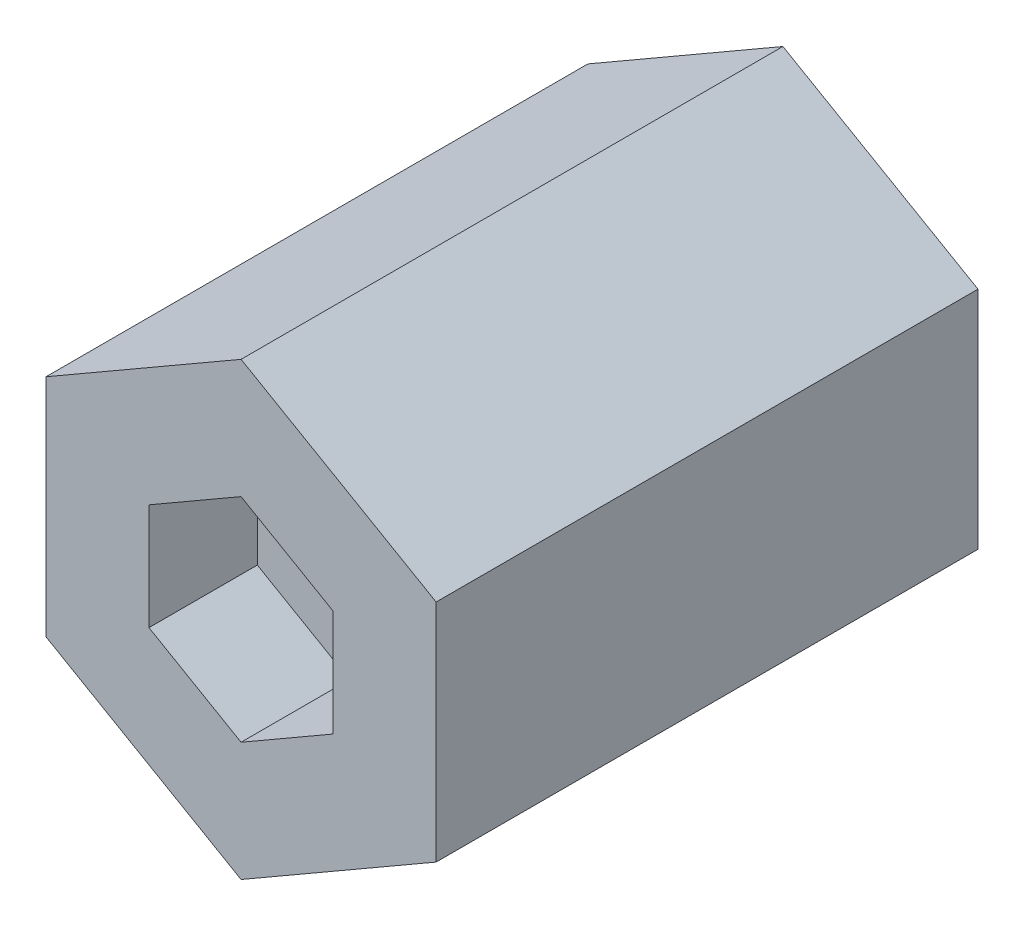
ISO-10303-21;
HEADER;
FILE_DESCRIPTION(('STEP AP214'),'2;1');
FILE_NAME('part.step','',(''),(''),'','','');
FILE_SCHEMA(('AUTOMOTIVE_DESIGN { 1 0 10303 214 1 1 1 1 }'));
ENDSEC;
DATA;
#1=APPLICATION_CONTEXT('core data for automotive mechanical design processes');
#2=APPLICATION_PROTOCOL_DEFINITION('international standard','automotive_design',2000,#1);
#3=PRODUCT_CONTEXT('',#1,'mechanical');
#4=PRODUCT('Part','Part','',(#3));
#5=PRODUCT_RELATED_PRODUCT_CATEGORY('part','',(#4));
#6=PRODUCT_DEFINITION_FORMATION('','',#4);
#7=PRODUCT_DEFINITION_CONTEXT('part definition',#1,'design');
#8=PRODUCT_DEFINITION('design','',#6,#7);
#9=PRODUCT_DEFINITION_SHAPE('','',#8);
#10=(LENGTH_UNIT() NAMED_UNIT(*) SI_UNIT(.MILLI.,.METRE.));
#11=(NAMED_UNIT(*) PLANE_ANGLE_UNIT() SI_UNIT($,.RADIAN.));
#12=(NAMED_UNIT(*) SI_UNIT($,.STERADIAN.) SOLID_ANGLE_UNIT());
#13=UNCERTAINTY_MEASURE_WITH_UNIT(LENGTH_MEASURE(1.E-05),#10,'distance_accuracy_value','');
#14=(GEOMETRIC_REPRESENTATION_CONTEXT(3) GLOBAL_UNCERTAINTY_ASSIGNED_CONTEXT((#13)) GLOBAL_UNIT_ASSIGNED_CONTEXT((#10,
#11,#12)) REPRESENTATION_CONTEXT('',''));
#15=CARTESIAN_POINT('',(0.,0.,0.));
#16=DIRECTION('',(0.,0.,1.));
#17=DIRECTION('',(1.,0.,0.));
#18=AXIS2_PLACEMENT_3D('',#15,#16,#17);
#19=CARTESIAN_POINT('',(18.,10.3923048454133,50.));
#20=DIRECTION('',(-0.5,-0.866025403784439,0.));
#21=DIRECTION('',(0.866025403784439,-0.5,0.));
#22=AXIS2_PLACEMENT_3D('',#19,#20,#21);
#23=PLANE('',#22);
#24=DIRECTION('',(-0.866025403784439,0.5,0.));
#25=VECTOR('',#24,1.);
#26=CARTESIAN_POINT('',(18.,10.3923048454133,0.));
#27=LINE('',#26,#25);
#28=CARTESIAN_POINT('',(18.,10.3923048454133,0.));
#29=VERTEX_POINT('',#28);
#30=CARTESIAN_POINT('',(0.,20.7846096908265,0.));
#31=VERTEX_POINT('',#30);
#32=EDGE_CURVE('E128',#29,#31,#27,.T.);
#33=ORIENTED_EDGE('',*,*,#32,.T.);
#34=DIRECTION('',(0.,0.,-1.));
#35=VECTOR('',#34,1.);
#36=CARTESIAN_POINT('',(0.,20.7846096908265,50.));
#37=LINE('',#36,#35);
#38=CARTESIAN_POINT('',(0.,20.7846096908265,50.));
#39=VERTEX_POINT('',#38);
#40=EDGE_CURVE('E11',#39,#31,#37,.T.);
#41=ORIENTED_EDGE('',*,*,#40,.F.);
#42=DIRECTION('',(-0.866025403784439,0.5,0.));
#43=VECTOR('',#42,1.);
#44=CARTESIAN_POINT('',(18.,10.3923048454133,50.));
#45=LINE('',#44,#43);
#46=CARTESIAN_POINT('',(18.,10.3923048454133,50.));
#47=VERTEX_POINT('',#46);
#48=EDGE_CURVE('E140',#47,#39,#45,.T.);
#49=ORIENTED_EDGE('',*,*,#48,.F.);
#50=DIRECTION('',(0.,0.,-1.));
#51=VECTOR('',#50,1.);
#52=CARTESIAN_POINT('',(18.,10.3923048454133,50.));
#53=LINE('',#52,#51);
#54=EDGE_CURVE('E124',#47,#29,#53,.T.);
#55=ORIENTED_EDGE('',*,*,#54,.T.);
#56=EDGE_LOOP('',(#33,#41,#49,#55));
#57=FACE_BOUND('',#56,.T.);
#58=ADVANCED_FACE('F32',(#57),#23,.F.);
#59=CARTESIAN_POINT('',(0.,20.7846096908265,50.));
#60=DIRECTION('',(0.5,-0.866025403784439,0.));
#61=DIRECTION('',(0.866025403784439,0.5,0.));
#62=AXIS2_PLACEMENT_3D('',#59,#60,#61);
#63=PLANE('',#62);
#64=DIRECTION('',(-0.866025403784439,-0.5,0.));
#65=VECTOR('',#64,1.);
#66=CARTESIAN_POINT('',(0.,20.7846096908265,0.));
#67=LINE('',#66,#65);
#68=CARTESIAN_POINT('',(-18.,10.3923048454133,0.));
#69=VERTEX_POINT('',#68);
#70=EDGE_CURVE('E131',#31,#69,#67,.T.);
#71=ORIENTED_EDGE('',*,*,#70,.T.);
#72=DIRECTION('',(0.,0.,-1.));
#73=VECTOR('',#72,1.);
#74=CARTESIAN_POINT('',(-18.,10.3923048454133,50.));
#75=LINE('',#74,#73);
#76=CARTESIAN_POINT('',(-18.,10.3923048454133,50.));
#77=VERTEX_POINT('',#76);
#78=EDGE_CURVE('E39',#77,#69,#75,.T.);
#79=ORIENTED_EDGE('',*,*,#78,.F.);
#80=DIRECTION('',(-0.866025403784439,-0.5,0.));
#81=VECTOR('',#80,1.);
#82=CARTESIAN_POINT('',(0.,20.7846096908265,50.));
#83=LINE('',#82,#81);
#84=EDGE_CURVE('E90',#39,#77,#83,.T.);
#85=ORIENTED_EDGE('',*,*,#84,.F.);
#86=ORIENTED_EDGE('',*,*,#40,.T.);
#87=EDGE_LOOP('',(#71,#79,#85,#86));
#88=FACE_BOUND('',#87,.T.);
#89=ADVANCED_FACE('F262',(#88),#63,.F.);
#90=CARTESIAN_POINT('',(-18.,10.3923048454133,50.));
#91=DIRECTION('',(1.,0.,0.));
#92=DIRECTION('',(0.,1.,0.));
#93=AXIS2_PLACEMENT_3D('',#90,#91,#92);
#94=PLANE('',#93);
#95=DIRECTION('',(0.,-1.,0.));
#96=VECTOR('',#95,1.);
#97=CARTESIAN_POINT('',(-18.,10.3923048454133,0.));
#98=LINE('',#97,#96);
#99=CARTESIAN_POINT('',(-18.,-10.3923048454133,0.));
#100=VERTEX_POINT('',#99);
#101=EDGE_CURVE('E134',#69,#100,#98,.T.);
#102=ORIENTED_EDGE('',*,*,#101,.T.);
#103=DIRECTION('',(0.,0.,-1.));
#104=VECTOR('',#103,1.);
#105=CARTESIAN_POINT('',(-18.,-10.3923048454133,50.));
#106=LINE('',#105,#104);
#107=CARTESIAN_POINT('',(-18.,-10.3923048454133,50.));
#108=VERTEX_POINT('',#107);
#109=EDGE_CURVE('E119',#108,#100,#106,.T.);
#110=ORIENTED_EDGE('',*,*,#109,.F.);
#111=DIRECTION('',(0.,-1.,0.));
#112=VECTOR('',#111,1.);
#113=CARTESIAN_POINT('',(-18.,10.3923048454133,50.));
#114=LINE('',#113,#112);
#115=EDGE_CURVE('E107',#77,#108,#114,.T.);
#116=ORIENTED_EDGE('',*,*,#115,.F.);
#117=ORIENTED_EDGE('',*,*,#78,.T.);
#118=EDGE_LOOP('',(#102,#110,#116,#117));
#119=FACE_BOUND('',#118,.T.);
#120=ADVANCED_FACE('F146',(#119),#94,.F.);
#121=CARTESIAN_POINT('',(-18.,-10.3923048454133,50.));
#122=DIRECTION('',(0.5,0.866025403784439,0.));
#123=DIRECTION('',(-0.866025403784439,0.5,0.));
#124=AXIS2_PLACEMENT_3D('',#121,#122,#123);
#125=PLANE('',#124);
#126=DIRECTION('',(0.866025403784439,-0.5,0.));
#127=VECTOR('',#126,1.);
#128=CARTESIAN_POINT('',(-18.,-10.3923048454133,0.));
#129=LINE('',#128,#127);
#130=CARTESIAN_POINT('',(0.,-20.7846096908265,0.));
#131=VERTEX_POINT('',#130);
#132=EDGE_CURVE('E116',#100,#131,#129,.T.);
#133=ORIENTED_EDGE('',*,*,#132,.T.);
#134=DIRECTION('',(0.,0.,-1.));
#135=VECTOR('',#134,1.);
#136=CARTESIAN_POINT('',(0.,-20.7846096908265,50.));
#137=LINE('',#136,#135);
#138=CARTESIAN_POINT('',(0.,-20.7846096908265,50.));
#139=VERTEX_POINT('',#138);
#140=EDGE_CURVE('E113',#139,#131,#137,.T.);
#141=ORIENTED_EDGE('',*,*,#140,.F.);
#142=DIRECTION('',(0.866025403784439,-0.5,0.));
#143=VECTOR('',#142,1.);
#144=CARTESIAN_POINT('',(-18.,-10.3923048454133,50.));
#145=LINE('',#144,#143);
#146=EDGE_CURVE('E100',#108,#139,#145,.T.);
#147=ORIENTED_EDGE('',*,*,#146,.F.);
#148=ORIENTED_EDGE('',*,*,#109,.T.);
#149=EDGE_LOOP('',(#133,#141,#147,#148));
#150=FACE_BOUND('',#149,.T.);
#151=ADVANCED_FACE('F114',(#150),#125,.F.);
#152=CARTESIAN_POINT('',(0.,-20.7846096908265,50.));
#153=DIRECTION('',(-0.5,0.866025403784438,0.));
#154=DIRECTION('',(-0.866025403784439,-0.5,0.));
#155=AXIS2_PLACEMENT_3D('',#152,#153,#154);
#156=PLANE('',#155);
#157=DIRECTION('',(0.866025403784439,0.5,0.));
#158=VECTOR('',#157,1.);
#159=CARTESIAN_POINT('',(0.,-20.7846096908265,0.));
#160=LINE('',#159,#158);
#161=CARTESIAN_POINT('',(18.,-10.3923048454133,0.));
#162=VERTEX_POINT('',#161);
#163=EDGE_CURVE('E137',#131,#162,#160,.T.);
#164=ORIENTED_EDGE('',*,*,#163,.T.);
#165=DIRECTION('',(0.,0.,-1.));
#166=VECTOR('',#165,1.);
#167=CARTESIAN_POINT('',(18.,-10.3923048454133,50.));
#168=LINE('',#167,#166);
#169=CARTESIAN_POINT('',(18.,-10.3923048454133,50.));
#170=VERTEX_POINT('',#169);
#171=EDGE_CURVE('E120',#170,#162,#168,.T.);
#172=ORIENTED_EDGE('',*,*,#171,.F.);
#173=DIRECTION('',(0.866025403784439,0.5,0.));
#174=VECTOR('',#173,1.);
#175=CARTESIAN_POINT('',(0.,-20.7846096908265,50.));
#176=LINE('',#175,#174);
#177=EDGE_CURVE('E104',#139,#170,#176,.T.);
#178=ORIENTED_EDGE('',*,*,#177,.F.);
#179=ORIENTED_EDGE('',*,*,#140,.T.);
#180=EDGE_LOOP('',(#164,#172,#178,#179));
#181=FACE_BOUND('',#180,.T.);
#182=ADVANCED_FACE('F122',(#181),#156,.F.);
#183=CARTESIAN_POINT('',(18.,-10.3923048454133,50.));
#184=DIRECTION('',(-1.,0.,0.));
#185=DIRECTION('',(0.,0.,1.));
#186=AXIS2_PLACEMENT_3D('',#183,#184,#185);
#187=PLANE('',#186);
#188=DIRECTION('',(0.,1.,0.));
#189=VECTOR('',#188,1.);
#190=CARTESIAN_POINT('',(18.,-10.3923048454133,0.));
#191=LINE('',#190,#189);
#192=EDGE_CURVE('E82',#162,#29,#191,.T.);
#193=ORIENTED_EDGE('',*,*,#192,.T.);
#194=ORIENTED_EDGE('',*,*,#54,.F.);
#195=DIRECTION('',(0.,1.,0.));
#196=VECTOR('',#195,1.);
#197=CARTESIAN_POINT('',(18.,-10.3923048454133,50.));
#198=LINE('',#197,#196);
#199=EDGE_CURVE('E55',#170,#47,#198,.T.);
#200=ORIENTED_EDGE('',*,*,#199,.F.);
#201=ORIENTED_EDGE('',*,*,#171,.T.);
#202=EDGE_LOOP('',(#193,#194,#200,#201));
#203=FACE_BOUND('',#202,.T.);
#204=ADVANCED_FACE('F150',(#203),#187,.F.);
#205=CARTESIAN_POINT('',(0.,20.7846096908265,50.));
#206=DIRECTION('',(0.,0.,1.));
#207=DIRECTION('',(1.,0.,0.));
#208=AXIS2_PLACEMENT_3D('',#205,#206,#207);
#209=PLANE('',#208);
#210=DIRECTION('',(-0.866025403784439,0.5,0.));
#211=VECTOR('',#210,1.);
#212=CARTESIAN_POINT('',(8.49999999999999,4.90747728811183,50.));
#213=LINE('',#212,#211);
#214=CARTESIAN_POINT('',(8.49999999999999,4.90747728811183,50.));
#215=VERTEX_POINT('',#214);
#216=CARTESIAN_POINT('',(0.,9.81495457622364,50.));
#217=VERTEX_POINT('',#216);
#218=EDGE_CURVE('E46',#215,#217,#213,.T.);
#219=ORIENTED_EDGE('',*,*,#218,.F.);
#220=DIRECTION('',(0.,1.,0.));
#221=VECTOR('',#220,1.);
#222=CARTESIAN_POINT('',(8.49999999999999,-4.90747728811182,50.));
#223=LINE('',#222,#221);
#224=CARTESIAN_POINT('',(8.49999999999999,-4.90747728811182,50.));
#225=VERTEX_POINT('',#224);
#226=EDGE_CURVE('E173',#225,#215,#223,.T.);
#227=ORIENTED_EDGE('',*,*,#226,.F.);
#228=DIRECTION('',(0.866025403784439,0.5,0.));
#229=VECTOR('',#228,1.);
#230=CARTESIAN_POINT('',(0.,-9.81495457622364,50.));
#231=LINE('',#230,#229);
#232=CARTESIAN_POINT('',(0.,-9.81495457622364,50.));
#233=VERTEX_POINT('',#232);
#234=EDGE_CURVE('E177',#233,#225,#231,.T.);
#235=ORIENTED_EDGE('',*,*,#234,.F.);
#236=DIRECTION('',(0.866025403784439,-0.5,0.));
#237=VECTOR('',#236,1.);
#238=CARTESIAN_POINT('',(-8.5,-4.90747728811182,50.));
#239=LINE('',#238,#237);
#240=CARTESIAN_POINT('',(-8.5,-4.90747728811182,50.));
#241=VERTEX_POINT('',#240);
#242=EDGE_CURVE('E180',#241,#233,#239,.T.);
#243=ORIENTED_EDGE('',*,*,#242,.F.);
#244=DIRECTION('',(0.,-1.,0.));
#245=VECTOR('',#244,1.);
#246=CARTESIAN_POINT('',(-8.5,4.90747728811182,50.));
#247=LINE('',#246,#245);
#248=CARTESIAN_POINT('',(-8.5,4.90747728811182,50.));
#249=VERTEX_POINT('',#248);
#250=EDGE_CURVE('E183',#249,#241,#247,.T.);
#251=ORIENTED_EDGE('',*,*,#250,.F.);
#252=DIRECTION('',(-0.866025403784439,-0.5,0.));
#253=VECTOR('',#252,1.);
#254=CARTESIAN_POINT('',(0.,9.81495457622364,50.));
#255=LINE('',#254,#253);
#256=EDGE_CURVE('E186',#217,#249,#255,.T.);
#257=ORIENTED_EDGE('',*,*,#256,.F.);
#258=EDGE_LOOP('',(#219,#227,#235,#243,#251,#257));
#259=FACE_BOUND('',#258,.T.);
#260=ORIENTED_EDGE('',*,*,#48,.T.);
#261=ORIENTED_EDGE('',*,*,#84,.T.);
#262=ORIENTED_EDGE('',*,*,#115,.T.);
#263=ORIENTED_EDGE('',*,*,#146,.T.);
#264=ORIENTED_EDGE('',*,*,#177,.T.);
#265=ORIENTED_EDGE('',*,*,#199,.T.);
#266=EDGE_LOOP('',(#260,#261,#262,#263,#264,#265));
#267=FACE_BOUND('',#266,.T.);
#268=ADVANCED_FACE('F102',(#259,#267),#209,.T.);
#269=CARTESIAN_POINT('',(0.,20.7846096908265,0.));
#270=DIRECTION('',(0.,0.,1.));
#271=DIRECTION('',(1.,0.,0.));
#272=AXIS2_PLACEMENT_3D('',#269,#270,#271);
#273=PLANE('',#272);
#274=ORIENTED_EDGE('',*,*,#32,.F.);
#275=ORIENTED_EDGE('',*,*,#192,.F.);
#276=ORIENTED_EDGE('',*,*,#163,.F.);
#277=ORIENTED_EDGE('',*,*,#132,.F.);
#278=ORIENTED_EDGE('',*,*,#101,.F.);
#279=ORIENTED_EDGE('',*,*,#70,.F.);
#280=EDGE_LOOP('',(#274,#275,#276,#277,#278,#279));
#281=FACE_BOUND('',#280,.T.);
#282=ADVANCED_FACE('F149',(#281),#273,.F.);
#283=CARTESIAN_POINT('',(8.49999999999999,4.90747728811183,40.));
#284=DIRECTION('',(0.5,0.866025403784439,0.));
#285=DIRECTION('',(-0.866025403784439,0.5,0.));
#286=AXIS2_PLACEMENT_3D('',#283,#284,#285);
#287=PLANE('',#286);
#288=ORIENTED_EDGE('',*,*,#218,.T.);
#289=DIRECTION('',(0.,0.,1.));
#290=VECTOR('',#289,1.);
#291=CARTESIAN_POINT('',(0.,9.81495457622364,40.));
#292=LINE('',#291,#290);
#293=CARTESIAN_POINT('',(0.,9.81495457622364,40.));
#294=VERTEX_POINT('',#293);
#295=EDGE_CURVE('E157',#294,#217,#292,.T.);
#296=ORIENTED_EDGE('',*,*,#295,.F.);
#297=DIRECTION('',(-0.866025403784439,0.5,0.));
#298=VECTOR('',#297,1.);
#299=CARTESIAN_POINT('',(8.49999999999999,4.90747728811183,40.));
#300=LINE('',#299,#298);
#301=CARTESIAN_POINT('',(8.49999999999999,4.90747728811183,40.));
#302=VERTEX_POINT('',#301);
#303=EDGE_CURVE('E176',#302,#294,#300,.T.);
#304=ORIENTED_EDGE('',*,*,#303,.F.);
#305=DIRECTION('',(0.,0.,1.));
#306=VECTOR('',#305,1.);
#307=CARTESIAN_POINT('',(8.49999999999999,4.90747728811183,40.));
#308=LINE('',#307,#306);
#309=EDGE_CURVE('E132',#302,#215,#308,.T.);
#310=ORIENTED_EDGE('',*,*,#309,.T.);
#311=EDGE_LOOP('',(#288,#296,#304,#310));
#312=FACE_BOUND('',#311,.T.);
#313=ADVANCED_FACE('F213',(#312),#287,.F.);
#314=CARTESIAN_POINT('',(8.49999999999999,-4.90747728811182,40.));
#315=DIRECTION('',(1.,0.,0.));
#316=DIRECTION('',(0.,1.,0.));
#317=AXIS2_PLACEMENT_3D('',#314,#315,#316);
#318=PLANE('',#317);
#319=ORIENTED_EDGE('',*,*,#226,.T.);
#320=ORIENTED_EDGE('',*,*,#309,.F.);
#321=DIRECTION('',(0.,1.,0.));
#322=VECTOR('',#321,1.);
#323=CARTESIAN_POINT('',(8.49999999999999,-4.90747728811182,40.));
#324=LINE('',#323,#322);
#325=CARTESIAN_POINT('',(8.49999999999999,-4.90747728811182,40.));
#326=VERTEX_POINT('',#325);
#327=EDGE_CURVE('E160',#326,#302,#324,.T.);
#328=ORIENTED_EDGE('',*,*,#327,.F.);
#329=DIRECTION('',(0.,0.,1.));
#330=VECTOR('',#329,1.);
#331=CARTESIAN_POINT('',(8.49999999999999,-4.90747728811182,40.));
#332=LINE('',#331,#330);
#333=EDGE_CURVE('E169',#326,#225,#332,.T.);
#334=ORIENTED_EDGE('',*,*,#333,.T.);
#335=EDGE_LOOP('',(#319,#320,#328,#334));
#336=FACE_BOUND('',#335,.T.);
#337=ADVANCED_FACE('F229',(#336),#318,.F.);
#338=CARTESIAN_POINT('',(0.,-9.81495457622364,40.));
#339=DIRECTION('',(0.5,-0.866025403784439,0.));
#340=DIRECTION('',(0.866025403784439,0.5,0.));
#341=AXIS2_PLACEMENT_3D('',#338,#339,#340);
#342=PLANE('',#341);
#343=ORIENTED_EDGE('',*,*,#234,.T.);
#344=ORIENTED_EDGE('',*,*,#333,.F.);
#345=DIRECTION('',(0.866025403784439,0.5,0.));
#346=VECTOR('',#345,1.);
#347=CARTESIAN_POINT('',(0.,-9.81495457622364,40.));
#348=LINE('',#347,#346);
#349=CARTESIAN_POINT('',(0.,-9.81495457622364,40.));
#350=VERTEX_POINT('',#349);
#351=EDGE_CURVE('E192',#350,#326,#348,.T.);
#352=ORIENTED_EDGE('',*,*,#351,.F.);
#353=DIRECTION('',(0.,0.,1.));
#354=VECTOR('',#353,1.);
#355=CARTESIAN_POINT('',(0.,-9.81495457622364,40.));
#356=LINE('',#355,#354);
#357=EDGE_CURVE('E166',#350,#233,#356,.T.);
#358=ORIENTED_EDGE('',*,*,#357,.T.);
#359=EDGE_LOOP('',(#343,#344,#352,#358));
#360=FACE_BOUND('',#359,.T.);
#361=ADVANCED_FACE('F234',(#360),#342,.F.);
#362=CARTESIAN_POINT('',(-8.5,-4.90747728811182,40.));
#363=DIRECTION('',(-0.5,-0.866025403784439,0.));
#364=DIRECTION('',(0.866025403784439,-0.5,0.));
#365=AXIS2_PLACEMENT_3D('',#362,#363,#364);
#366=PLANE('',#365);
#367=ORIENTED_EDGE('',*,*,#242,.T.);
#368=ORIENTED_EDGE('',*,*,#357,.F.);
#369=DIRECTION('',(0.866025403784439,-0.5,0.));
#370=VECTOR('',#369,1.);
#371=CARTESIAN_POINT('',(-8.5,-4.90747728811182,40.));
#372=LINE('',#371,#370);
#373=CARTESIAN_POINT('',(-8.5,-4.90747728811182,40.));
#374=VERTEX_POINT('',#373);
#375=EDGE_CURVE('E195',#374,#350,#372,.T.);
#376=ORIENTED_EDGE('',*,*,#375,.F.);
#377=DIRECTION('',(0.,0.,1.));
#378=VECTOR('',#377,1.);
#379=CARTESIAN_POINT('',(-8.5,-4.90747728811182,40.));
#380=LINE('',#379,#378);
#381=EDGE_CURVE('E163',#374,#241,#380,.T.);
#382=ORIENTED_EDGE('',*,*,#381,.T.);
#383=EDGE_LOOP('',(#367,#368,#376,#382));
#384=FACE_BOUND('',#383,.T.);
#385=ADVANCED_FACE('F252',(#384),#366,.F.);
#386=CARTESIAN_POINT('',(-8.5,4.90747728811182,40.));
#387=DIRECTION('',(-1.,0.,0.));
#388=DIRECTION('',(0.,-1.,0.));
#389=AXIS2_PLACEMENT_3D('',#386,#387,#388);
#390=PLANE('',#389);
#391=ORIENTED_EDGE('',*,*,#250,.T.);
#392=ORIENTED_EDGE('',*,*,#381,.F.);
#393=DIRECTION('',(0.,-1.,0.));
#394=VECTOR('',#393,1.);
#395=CARTESIAN_POINT('',(-8.5,4.90747728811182,40.));
#396=LINE('',#395,#394);
#397=CARTESIAN_POINT('',(-8.5,4.90747728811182,40.));
#398=VERTEX_POINT('',#397);
#399=EDGE_CURVE('E198',#398,#374,#396,.T.);
#400=ORIENTED_EDGE('',*,*,#399,.F.);
#401=DIRECTION('',(0.,0.,1.));
#402=VECTOR('',#401,1.);
#403=CARTESIAN_POINT('',(-8.5,4.90747728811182,40.));
#404=LINE('',#403,#402);
#405=EDGE_CURVE('E159',#398,#249,#404,.T.);
#406=ORIENTED_EDGE('',*,*,#405,.T.);
#407=EDGE_LOOP('',(#391,#392,#400,#406));
#408=FACE_BOUND('',#407,.T.);
#409=ADVANCED_FACE('F248',(#408),#390,.F.);
#410=CARTESIAN_POINT('',(0.,9.81495457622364,40.));
#411=DIRECTION('',(-0.5,0.866025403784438,0.));
#412=DIRECTION('',(-0.866025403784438,-0.5,0.));
#413=AXIS2_PLACEMENT_3D('',#410,#411,#412);
#414=PLANE('',#413);
#415=ORIENTED_EDGE('',*,*,#256,.T.);
#416=ORIENTED_EDGE('',*,*,#405,.F.);
#417=DIRECTION('',(-0.866025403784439,-0.5,0.));
#418=VECTOR('',#417,1.);
#419=CARTESIAN_POINT('',(0.,9.81495457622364,40.));
#420=LINE('',#419,#418);
#421=EDGE_CURVE('E201',#294,#398,#420,.T.);
#422=ORIENTED_EDGE('',*,*,#421,.F.);
#423=ORIENTED_EDGE('',*,*,#295,.T.);
#424=EDGE_LOOP('',(#415,#416,#422,#423));
#425=FACE_BOUND('',#424,.T.);
#426=ADVANCED_FACE('F242',(#425),#414,.F.);
#427=CARTESIAN_POINT('',(0.,9.81495457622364,40.));
#428=DIRECTION('',(0.,0.,1.));
#429=DIRECTION('',(1.,0.,0.));
#430=AXIS2_PLACEMENT_3D('',#427,#428,#429);
#431=PLANE('',#430);
#432=ORIENTED_EDGE('',*,*,#303,.T.);
#433=ORIENTED_EDGE('',*,*,#421,.T.);
#434=ORIENTED_EDGE('',*,*,#399,.T.);
#435=ORIENTED_EDGE('',*,*,#375,.T.);
#436=ORIENTED_EDGE('',*,*,#351,.T.);
#437=ORIENTED_EDGE('',*,*,#327,.T.);
#438=EDGE_LOOP('',(#432,#433,#434,#435,#436,#437));
#439=FACE_BOUND('',#438,.T.);
#440=ADVANCED_FACE('F208',(#439),#431,.T.);
#441=CLOSED_SHELL('',(#58,#89,#120,#151,#182,#204,#268,#282,#313,#337,#361,#385,#409,#426,#440));
#442=MANIFOLD_SOLID_BREP('B2',#441);
#443=ADVANCED_BREP_SHAPE_REPRESENTATION('',(#18,#442),#14);
#444=SHAPE_DEFINITION_REPRESENTATION(#9,#443);
ENDSEC;
END-ISO-10303-21;
